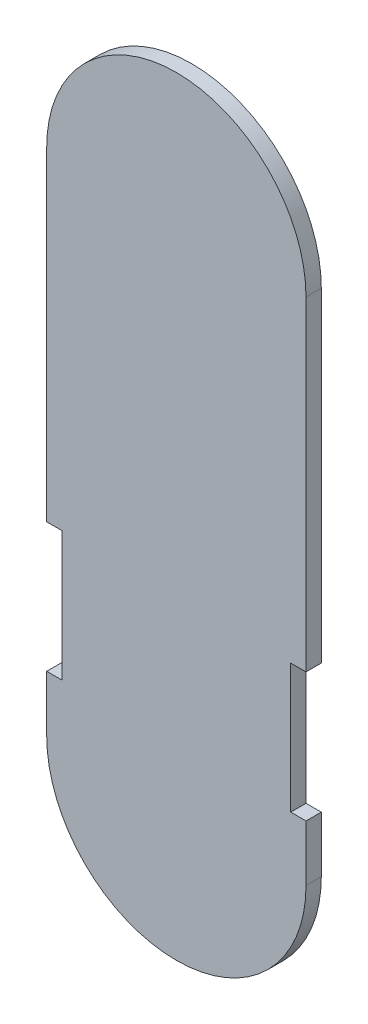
ISO-10303-21;
HEADER;
FILE_DESCRIPTION(('STEP AP214'),'2;1');
FILE_NAME('part.step','',(''),(''),'','','');
FILE_SCHEMA(('AUTOMOTIVE_DESIGN { 1 0 10303 214 1 1 1 1 }'));
ENDSEC;
DATA;
#1=APPLICATION_CONTEXT('core data for automotive mechanical design processes');
#2=APPLICATION_PROTOCOL_DEFINITION('international standard','automotive_design',2000,#1);
#3=PRODUCT_CONTEXT('',#1,'mechanical');
#4=PRODUCT('Part','Part','',(#3));
#5=PRODUCT_RELATED_PRODUCT_CATEGORY('part','',(#4));
#6=PRODUCT_DEFINITION_FORMATION('','',#4);
#7=PRODUCT_DEFINITION_CONTEXT('part definition',#1,'design');
#8=PRODUCT_DEFINITION('design','',#6,#7);
#9=PRODUCT_DEFINITION_SHAPE('','',#8);
#10=(LENGTH_UNIT() NAMED_UNIT(*) SI_UNIT(.MILLI.,.METRE.));
#11=(NAMED_UNIT(*) PLANE_ANGLE_UNIT() SI_UNIT($,.RADIAN.));
#12=(NAMED_UNIT(*) SI_UNIT($,.STERADIAN.) SOLID_ANGLE_UNIT());
#13=UNCERTAINTY_MEASURE_WITH_UNIT(LENGTH_MEASURE(1.E-05),#10,'distance_accuracy_value','');
#14=(GEOMETRIC_REPRESENTATION_CONTEXT(3) GLOBAL_UNCERTAINTY_ASSIGNED_CONTEXT((#13)) GLOBAL_UNIT_ASSIGNED_CONTEXT((#10,
#11,#12)) REPRESENTATION_CONTEXT('',''));
#15=CARTESIAN_POINT('',(0.,0.,0.));
#16=DIRECTION('',(0.,0.,1.));
#17=DIRECTION('',(1.,0.,0.));
#18=AXIS2_PLACEMENT_3D('',#15,#16,#17);
#19=CARTESIAN_POINT('',(26.0514524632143,-23.650430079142,1.524));
#20=DIRECTION('',(0.,1.,0.));
#21=DIRECTION('',(0.,0.,1.));
#22=AXIS2_PLACEMENT_3D('',#19,#20,#21);
#23=PLANE('',#22);
#24=DIRECTION('',(1.,0.,0.));
#25=VECTOR('',#24,1.);
#26=CARTESIAN_POINT('',(26.0514524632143,-23.650430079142,0.));
#27=LINE('',#26,#25);
#28=CARTESIAN_POINT('',(24.5274524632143,-23.650430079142,0.));
#29=VERTEX_POINT('',#28);
#30=CARTESIAN_POINT('',(26.0514524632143,-23.650430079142,0.));
#31=VERTEX_POINT('',#30);
#32=EDGE_CURVE('E152',#29,#31,#27,.T.);
#33=ORIENTED_EDGE('',*,*,#32,.T.);
#34=DIRECTION('',(0.,0.,-1.));
#35=VECTOR('',#34,1.);
#36=CARTESIAN_POINT('',(26.0514524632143,-23.650430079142,1.524));
#37=LINE('',#36,#35);
#38=CARTESIAN_POINT('',(26.0514524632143,-23.650430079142,1.524));
#39=VERTEX_POINT('',#38);
#40=EDGE_CURVE('E11',#39,#31,#37,.T.);
#41=ORIENTED_EDGE('',*,*,#40,.F.);
#42=DIRECTION('',(1.,0.,0.));
#43=VECTOR('',#42,1.);
#44=CARTESIAN_POINT('',(26.0514524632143,-23.650430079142,1.524));
#45=LINE('',#44,#43);
#46=CARTESIAN_POINT('',(24.5274524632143,-23.650430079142,1.524));
#47=VERTEX_POINT('',#46);
#48=EDGE_CURVE('E174',#47,#39,#45,.T.);
#49=ORIENTED_EDGE('',*,*,#48,.F.);
#50=DIRECTION('',(0.,0.,-1.));
#51=VECTOR('',#50,1.);
#52=CARTESIAN_POINT('',(24.5274524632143,-23.650430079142,1.524));
#53=LINE('',#52,#51);
#54=EDGE_CURVE('E148',#47,#29,#53,.T.);
#55=ORIENTED_EDGE('',*,*,#54,.T.);
#56=EDGE_LOOP('',(#33,#41,#49,#55));
#57=FACE_BOUND('',#56,.T.);
#58=ADVANCED_FACE('F32',(#57),#23,.F.);
#59=CARTESIAN_POINT('',(26.0514524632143,8.70992047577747,1.524));
#60=DIRECTION('',(-1.,0.,0.));
#61=DIRECTION('',(0.,0.,1.));
#62=AXIS2_PLACEMENT_3D('',#59,#60,#61);
#63=PLANE('',#62);
#64=DIRECTION('',(0.,1.,0.));
#65=VECTOR('',#64,1.);
#66=CARTESIAN_POINT('',(26.0514524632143,8.70992047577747,0.));
#67=LINE('',#66,#65);
#68=CARTESIAN_POINT('',(26.0514524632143,8.70992047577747,0.));
#69=VERTEX_POINT('',#68);
#70=EDGE_CURVE('E155',#31,#69,#67,.T.);
#71=ORIENTED_EDGE('',*,*,#70,.T.);
#72=DIRECTION('',(0.,0.,-1.));
#73=VECTOR('',#72,1.);
#74=CARTESIAN_POINT('',(26.0514524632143,8.70992047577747,1.524));
#75=LINE('',#74,#73);
#76=CARTESIAN_POINT('',(26.0514524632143,8.70992047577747,1.524));
#77=VERTEX_POINT('',#76);
#78=EDGE_CURVE('E40',#77,#69,#75,.T.);
#79=ORIENTED_EDGE('',*,*,#78,.F.);
#80=DIRECTION('',(0.,1.,0.));
#81=VECTOR('',#80,1.);
#82=CARTESIAN_POINT('',(26.0514524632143,8.70992047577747,1.524));
#83=LINE('',#82,#81);
#84=EDGE_CURVE('E103',#39,#77,#83,.T.);
#85=ORIENTED_EDGE('',*,*,#84,.F.);
#86=ORIENTED_EDGE('',*,*,#40,.T.);
#87=EDGE_LOOP('',(#71,#79,#85,#86));
#88=FACE_BOUND('',#87,.T.);
#89=ADVANCED_FACE('F252',(#88),#63,.F.);
#90=CARTESIAN_POINT('',(13.1287296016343,8.70992047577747,1.524));
#91=DIRECTION('',(0.,0.,-1.));
#92=DIRECTION('',(-1.,0.,0.));
#93=AXIS2_PLACEMENT_3D('',#90,#91,#92);
#94=CYLINDRICAL_SURFACE('',#93,12.92272286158);
#95=CARTESIAN_POINT('',(13.1287296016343,8.70992047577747,0.));
#96=DIRECTION('',(0.,0.,1.));
#97=DIRECTION('',(1.,0.,0.));
#98=AXIS2_PLACEMENT_3D('',#95,#96,#97);
#99=CIRCLE('',#98,12.92272286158);
#100=CARTESIAN_POINT('',(0.206006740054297,8.70992047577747,0.));
#101=VERTEX_POINT('',#100);
#102=EDGE_CURVE('E157',#69,#101,#99,.T.);
#103=ORIENTED_EDGE('',*,*,#102,.T.);
#104=DIRECTION('',(0.,0.,-1.));
#105=VECTOR('',#104,1.);
#106=CARTESIAN_POINT('',(0.206006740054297,8.70992047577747,1.524));
#107=LINE('',#106,#105);
#108=CARTESIAN_POINT('',(0.206006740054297,8.70992047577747,1.524));
#109=VERTEX_POINT('',#108);
#110=EDGE_CURVE('E193',#109,#101,#107,.T.);
#111=ORIENTED_EDGE('',*,*,#110,.F.);
#112=CARTESIAN_POINT('',(13.1287296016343,8.70992047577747,1.524));
#113=DIRECTION('',(0.,0.,1.));
#114=DIRECTION('',(1.,0.,0.));
#115=AXIS2_PLACEMENT_3D('',#112,#113,#114);
#116=CIRCLE('',#115,12.92272286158);
#117=EDGE_CURVE('E201',#77,#109,#116,.T.);
#118=ORIENTED_EDGE('',*,*,#117,.F.);
#119=ORIENTED_EDGE('',*,*,#78,.T.);
#120=EDGE_LOOP('',(#103,#111,#118,#119));
#121=FACE_BOUND('',#120,.T.);
#122=ADVANCED_FACE('F199',(#121),#94,.T.);
#123=CARTESIAN_POINT('',(0.206006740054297,8.70992047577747,1.524));
#124=DIRECTION('',(1.,0.,0.));
#125=DIRECTION('',(0.,1.,0.));
#126=AXIS2_PLACEMENT_3D('',#123,#124,#125);
#127=PLANE('',#126);
#128=DIRECTION('',(0.,-1.,0.));
#129=VECTOR('',#128,1.);
#130=CARTESIAN_POINT('',(0.206006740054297,8.70992047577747,0.));
#131=LINE('',#130,#129);
#132=CARTESIAN_POINT('',(0.206006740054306,-23.6211874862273,0.));
#133=VERTEX_POINT('',#132);
#134=EDGE_CURVE('E159',#101,#133,#131,.T.);
#135=ORIENTED_EDGE('',*,*,#134,.T.);
#136=DIRECTION('',(0.,0.,-1.));
#137=VECTOR('',#136,1.);
#138=CARTESIAN_POINT('',(0.206006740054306,-23.6211874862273,1.524));
#139=LINE('',#138,#137);
#140=CARTESIAN_POINT('',(0.206006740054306,-23.6211874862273,1.524));
#141=VERTEX_POINT('',#140);
#142=EDGE_CURVE('E190',#141,#133,#139,.T.);
#143=ORIENTED_EDGE('',*,*,#142,.F.);
#144=DIRECTION('',(0.,-1.,0.));
#145=VECTOR('',#144,1.);
#146=CARTESIAN_POINT('',(0.206006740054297,8.70992047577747,1.524));
#147=LINE('',#146,#145);
#148=EDGE_CURVE('E219',#109,#141,#147,.T.);
#149=ORIENTED_EDGE('',*,*,#148,.F.);
#150=ORIENTED_EDGE('',*,*,#110,.T.);
#151=EDGE_LOOP('',(#135,#143,#149,#150));
#152=FACE_BOUND('',#151,.T.);
#153=ADVANCED_FACE('F210',(#152),#127,.F.);
#154=CARTESIAN_POINT('',(1.72528777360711,-23.6211874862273,1.524));
#155=DIRECTION('',(0.,1.,0.));
#156=DIRECTION('',(0.,0.,1.));
#157=AXIS2_PLACEMENT_3D('',#154,#155,#156);
#158=PLANE('',#157);
#159=DIRECTION('',(1.,0.,0.));
#160=VECTOR('',#159,1.);
#161=CARTESIAN_POINT('',(1.72528777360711,-23.6211874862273,0.));
#162=LINE('',#161,#160);
#163=CARTESIAN_POINT('',(1.72528777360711,-23.6211874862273,0.));
#164=VERTEX_POINT('',#163);
#165=EDGE_CURVE('E161',#133,#164,#162,.T.);
#166=ORIENTED_EDGE('',*,*,#165,.T.);
#167=DIRECTION('',(0.,0.,-1.));
#168=VECTOR('',#167,1.);
#169=CARTESIAN_POINT('',(1.72528777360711,-23.6211874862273,1.524));
#170=LINE('',#169,#168);
#171=CARTESIAN_POINT('',(1.72528777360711,-23.6211874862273,1.524));
#172=VERTEX_POINT('',#171);
#173=EDGE_CURVE('E187',#172,#164,#170,.T.);
#174=ORIENTED_EDGE('',*,*,#173,.F.);
#175=DIRECTION('',(1.,0.,0.));
#176=VECTOR('',#175,1.);
#177=CARTESIAN_POINT('',(1.72528777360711,-23.6211874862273,1.524));
#178=LINE('',#177,#176);
#179=EDGE_CURVE('E216',#141,#172,#178,.T.);
#180=ORIENTED_EDGE('',*,*,#179,.F.);
#181=ORIENTED_EDGE('',*,*,#142,.T.);
#182=EDGE_LOOP('',(#166,#174,#180,#181));
#183=FACE_BOUND('',#182,.T.);
#184=ADVANCED_FACE('F214',(#183),#158,.F.);
#185=CARTESIAN_POINT('',(1.72528777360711,-36.5181421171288,1.524));
#186=DIRECTION('',(1.,0.,0.));
#187=DIRECTION('',(0.,0.,-1.));
#188=AXIS2_PLACEMENT_3D('',#185,#186,#187);
#189=PLANE('',#188);
#190=DIRECTION('',(0.,-1.,0.));
#191=VECTOR('',#190,1.);
#192=CARTESIAN_POINT('',(1.72528777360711,-36.5181421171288,0.));
#193=LINE('',#192,#191);
#194=CARTESIAN_POINT('',(1.72528777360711,-36.5181421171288,0.));
#195=VERTEX_POINT('',#194);
#196=EDGE_CURVE('E163',#164,#195,#193,.T.);
#197=ORIENTED_EDGE('',*,*,#196,.T.);
#198=DIRECTION('',(0.,0.,-1.));
#199=VECTOR('',#198,1.);
#200=CARTESIAN_POINT('',(1.72528777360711,-36.5181421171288,1.524));
#201=LINE('',#200,#199);
#202=CARTESIAN_POINT('',(1.72528777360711,-36.5181421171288,1.524));
#203=VERTEX_POINT('',#202);
#204=EDGE_CURVE('E184',#203,#195,#201,.T.);
#205=ORIENTED_EDGE('',*,*,#204,.F.);
#206=DIRECTION('',(0.,-1.,0.));
#207=VECTOR('',#206,1.);
#208=CARTESIAN_POINT('',(1.72528777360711,-36.5181421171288,1.524));
#209=LINE('',#208,#207);
#210=EDGE_CURVE('E218',#172,#203,#209,.T.);
#211=ORIENTED_EDGE('',*,*,#210,.F.);
#212=ORIENTED_EDGE('',*,*,#173,.T.);
#213=EDGE_LOOP('',(#197,#205,#211,#212));
#214=FACE_BOUND('',#213,.T.);
#215=ADVANCED_FACE('F265',(#214),#189,.F.);
#216=CARTESIAN_POINT('',(1.72528777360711,-36.5181421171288,1.524));
#217=DIRECTION('',(0.,-1.,0.));
#218=DIRECTION('',(0.,0.,-1.));
#219=AXIS2_PLACEMENT_3D('',#216,#217,#218);
#220=PLANE('',#219);
#221=DIRECTION('',(-1.,0.,0.));
#222=VECTOR('',#221,1.);
#223=CARTESIAN_POINT('',(1.72528777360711,-36.5181421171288,0.));
#224=LINE('',#223,#222);
#225=CARTESIAN_POINT('',(0.206006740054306,-36.5181421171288,0.));
#226=VERTEX_POINT('',#225);
#227=EDGE_CURVE('E165',#195,#226,#224,.T.);
#228=ORIENTED_EDGE('',*,*,#227,.T.);
#229=DIRECTION('',(0.,0.,-1.));
#230=VECTOR('',#229,1.);
#231=CARTESIAN_POINT('',(0.206006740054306,-36.5181421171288,1.524));
#232=LINE('',#231,#230);
#233=CARTESIAN_POINT('',(0.206006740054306,-36.5181421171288,1.524));
#234=VERTEX_POINT('',#233);
#235=EDGE_CURVE('E181',#234,#226,#232,.T.);
#236=ORIENTED_EDGE('',*,*,#235,.F.);
#237=DIRECTION('',(-1.,0.,0.));
#238=VECTOR('',#237,1.);
#239=CARTESIAN_POINT('',(1.72528777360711,-36.5181421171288,1.524));
#240=LINE('',#239,#238);
#241=EDGE_CURVE('E221',#203,#234,#240,.T.);
#242=ORIENTED_EDGE('',*,*,#241,.F.);
#243=ORIENTED_EDGE('',*,*,#204,.T.);
#244=EDGE_LOOP('',(#228,#236,#242,#243));
#245=FACE_BOUND('',#244,.T.);
#246=ADVANCED_FACE('F268',(#245),#220,.F.);
#247=CARTESIAN_POINT('',(0.206006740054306,-36.5181421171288,1.524));
#248=DIRECTION('',(1.,0.,0.));
#249=DIRECTION('',(0.,1.,0.));
#250=AXIS2_PLACEMENT_3D('',#247,#248,#249);
#251=PLANE('',#250);
#252=DIRECTION('',(0.,-1.,0.));
#253=VECTOR('',#252,1.);
#254=CARTESIAN_POINT('',(0.206006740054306,-36.5181421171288,0.));
#255=LINE('',#254,#253);
#256=CARTESIAN_POINT('',(0.206006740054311,-42.0900795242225,0.));
#257=VERTEX_POINT('',#256);
#258=EDGE_CURVE('E167',#226,#257,#255,.T.);
#259=ORIENTED_EDGE('',*,*,#258,.T.);
#260=DIRECTION('',(0.,0.,-1.));
#261=VECTOR('',#260,1.);
#262=CARTESIAN_POINT('',(0.206006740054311,-42.0900795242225,1.524));
#263=LINE('',#262,#261);
#264=CARTESIAN_POINT('',(0.206006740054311,-42.0900795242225,1.524));
#265=VERTEX_POINT('',#264);
#266=EDGE_CURVE('E178',#265,#257,#263,.T.);
#267=ORIENTED_EDGE('',*,*,#266,.F.);
#268=DIRECTION('',(0.,-1.,0.));
#269=VECTOR('',#268,1.);
#270=CARTESIAN_POINT('',(0.206006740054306,-36.5181421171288,1.524));
#271=LINE('',#270,#269);
#272=EDGE_CURVE('E227',#234,#265,#271,.T.);
#273=ORIENTED_EDGE('',*,*,#272,.F.);
#274=ORIENTED_EDGE('',*,*,#235,.T.);
#275=EDGE_LOOP('',(#259,#267,#273,#274));
#276=FACE_BOUND('',#275,.T.);
#277=ADVANCED_FACE('F233',(#276),#251,.F.);
#278=CARTESIAN_POINT('',(13.1287296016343,-42.0900795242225,1.524));
#279=DIRECTION('',(0.,0.,-1.));
#280=DIRECTION('',(-1.,0.,0.));
#281=AXIS2_PLACEMENT_3D('',#278,#279,#280);
#282=CYLINDRICAL_SURFACE('',#281,12.92272286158);
#283=CARTESIAN_POINT('',(13.1287296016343,-42.0900795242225,0.));
#284=DIRECTION('',(0.,0.,1.));
#285=DIRECTION('',(1.,0.,0.));
#286=AXIS2_PLACEMENT_3D('',#283,#284,#285);
#287=CIRCLE('',#286,12.92272286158);
#288=CARTESIAN_POINT('',(26.0514524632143,-42.0900795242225,0.));
#289=VERTEX_POINT('',#288);
#290=EDGE_CURVE('E169',#257,#289,#287,.T.);
#291=ORIENTED_EDGE('',*,*,#290,.T.);
#292=DIRECTION('',(0.,0.,-1.));
#293=VECTOR('',#292,1.);
#294=CARTESIAN_POINT('',(26.0514524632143,-42.0900795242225,1.524));
#295=LINE('',#294,#293);
#296=CARTESIAN_POINT('',(26.0514524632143,-42.0900795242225,1.524));
#297=VERTEX_POINT('',#296);
#298=EDGE_CURVE('E143',#297,#289,#295,.T.);
#299=ORIENTED_EDGE('',*,*,#298,.F.);
#300=CARTESIAN_POINT('',(13.1287296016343,-42.0900795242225,1.524));
#301=DIRECTION('',(0.,0.,1.));
#302=DIRECTION('',(1.,0.,0.));
#303=AXIS2_PLACEMENT_3D('',#300,#301,#302);
#304=CIRCLE('',#303,12.92272286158);
#305=EDGE_CURVE('E134',#265,#297,#304,.T.);
#306=ORIENTED_EDGE('',*,*,#305,.F.);
#307=ORIENTED_EDGE('',*,*,#266,.T.);
#308=EDGE_LOOP('',(#291,#299,#306,#307));
#309=FACE_BOUND('',#308,.T.);
#310=ADVANCED_FACE('F237',(#309),#282,.T.);
#311=CARTESIAN_POINT('',(26.0514524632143,-36.5153857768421,1.524));
#312=DIRECTION('',(-1.,0.,0.));
#313=DIRECTION('',(0.,0.,1.));
#314=AXIS2_PLACEMENT_3D('',#311,#312,#313);
#315=PLANE('',#314);
#316=DIRECTION('',(0.,1.,0.));
#317=VECTOR('',#316,1.);
#318=CARTESIAN_POINT('',(26.0514524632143,-36.5153857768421,0.));
#319=LINE('',#318,#317);
#320=CARTESIAN_POINT('',(26.0514524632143,-36.5153857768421,0.));
#321=VERTEX_POINT('',#320);
#322=EDGE_CURVE('E142',#289,#321,#319,.T.);
#323=ORIENTED_EDGE('',*,*,#322,.T.);
#324=DIRECTION('',(0.,0.,-1.));
#325=VECTOR('',#324,1.);
#326=CARTESIAN_POINT('',(26.0514524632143,-36.5153857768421,1.524));
#327=LINE('',#326,#325);
#328=CARTESIAN_POINT('',(26.0514524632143,-36.5153857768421,1.524));
#329=VERTEX_POINT('',#328);
#330=EDGE_CURVE('E139',#329,#321,#327,.T.);
#331=ORIENTED_EDGE('',*,*,#330,.F.);
#332=DIRECTION('',(0.,1.,0.));
#333=VECTOR('',#332,1.);
#334=CARTESIAN_POINT('',(26.0514524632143,-36.5153857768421,1.524));
#335=LINE('',#334,#333);
#336=EDGE_CURVE('E128',#297,#329,#335,.T.);
#337=ORIENTED_EDGE('',*,*,#336,.F.);
#338=ORIENTED_EDGE('',*,*,#298,.T.);
#339=EDGE_LOOP('',(#323,#331,#337,#338));
#340=FACE_BOUND('',#339,.T.);
#341=ADVANCED_FACE('F140',(#340),#315,.F.);
#342=CARTESIAN_POINT('',(26.0514524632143,-36.5153857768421,1.524));
#343=DIRECTION('',(0.,-1.,0.));
#344=DIRECTION('',(0.,0.,-1.));
#345=AXIS2_PLACEMENT_3D('',#342,#343,#344);
#346=PLANE('',#345);
#347=DIRECTION('',(-1.,0.,0.));
#348=VECTOR('',#347,1.);
#349=CARTESIAN_POINT('',(26.0514524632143,-36.5153857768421,0.));
#350=LINE('',#349,#348);
#351=CARTESIAN_POINT('',(24.5274524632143,-36.5153857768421,0.));
#352=VERTEX_POINT('',#351);
#353=EDGE_CURVE('E89',#321,#352,#350,.T.);
#354=ORIENTED_EDGE('',*,*,#353,.T.);
#355=DIRECTION('',(0.,0.,-1.));
#356=VECTOR('',#355,1.);
#357=CARTESIAN_POINT('',(24.5274524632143,-36.5153857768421,1.524));
#358=LINE('',#357,#356);
#359=CARTESIAN_POINT('',(24.5274524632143,-36.5153857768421,1.524));
#360=VERTEX_POINT('',#359);
#361=EDGE_CURVE('E144',#360,#352,#358,.T.);
#362=ORIENTED_EDGE('',*,*,#361,.F.);
#363=DIRECTION('',(-1.,0.,0.));
#364=VECTOR('',#363,1.);
#365=CARTESIAN_POINT('',(26.0514524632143,-36.5153857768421,1.524));
#366=LINE('',#365,#364);
#367=EDGE_CURVE('E132',#329,#360,#366,.T.);
#368=ORIENTED_EDGE('',*,*,#367,.F.);
#369=ORIENTED_EDGE('',*,*,#330,.T.);
#370=EDGE_LOOP('',(#354,#362,#368,#369));
#371=FACE_BOUND('',#370,.T.);
#372=ADVANCED_FACE('F146',(#371),#346,.F.);
#373=CARTESIAN_POINT('',(24.5274524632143,-23.650430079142,1.524));
#374=DIRECTION('',(-1.,0.,0.));
#375=DIRECTION('',(0.,0.,1.));
#376=AXIS2_PLACEMENT_3D('',#373,#374,#375);
#377=PLANE('',#376);
#378=DIRECTION('',(0.,1.,0.));
#379=VECTOR('',#378,1.);
#380=CARTESIAN_POINT('',(24.5274524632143,-23.650430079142,0.));
#381=LINE('',#380,#379);
#382=EDGE_CURVE('E95',#352,#29,#381,.T.);
#383=ORIENTED_EDGE('',*,*,#382,.T.);
#384=ORIENTED_EDGE('',*,*,#54,.F.);
#385=DIRECTION('',(0.,1.,0.));
#386=VECTOR('',#385,1.);
#387=CARTESIAN_POINT('',(24.5274524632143,-23.650430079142,1.524));
#388=LINE('',#387,#386);
#389=EDGE_CURVE('E48',#360,#47,#388,.T.);
#390=ORIENTED_EDGE('',*,*,#389,.F.);
#391=ORIENTED_EDGE('',*,*,#361,.T.);
#392=EDGE_LOOP('',(#383,#384,#390,#391));
#393=FACE_BOUND('',#392,.T.);
#394=ADVANCED_FACE('F241',(#393),#377,.F.);
#395=CARTESIAN_POINT('',(13.1287296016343,-42.0900795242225,1.524));
#396=DIRECTION('',(0.,0.,1.));
#397=DIRECTION('',(1.,0.,0.));
#398=AXIS2_PLACEMENT_3D('',#395,#396,#397);
#399=PLANE('',#398);
#400=ORIENTED_EDGE('',*,*,#48,.T.);
#401=ORIENTED_EDGE('',*,*,#84,.T.);
#402=ORIENTED_EDGE('',*,*,#117,.T.);
#403=ORIENTED_EDGE('',*,*,#148,.T.);
#404=ORIENTED_EDGE('',*,*,#179,.T.);
#405=ORIENTED_EDGE('',*,*,#210,.T.);
#406=ORIENTED_EDGE('',*,*,#241,.T.);
#407=ORIENTED_EDGE('',*,*,#272,.T.);
#408=ORIENTED_EDGE('',*,*,#305,.T.);
#409=ORIENTED_EDGE('',*,*,#336,.T.);
#410=ORIENTED_EDGE('',*,*,#367,.T.);
#411=ORIENTED_EDGE('',*,*,#389,.T.);
#412=EDGE_LOOP('',(#400,#401,#402,#403,#404,#405,#406,#407,#408,#409,#410,#411));
#413=FACE_BOUND('',#412,.T.);
#414=ADVANCED_FACE('F130',(#413),#399,.T.);
#415=CARTESIAN_POINT('',(13.1287296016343,-42.0900795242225,0.));
#416=DIRECTION('',(0.,0.,1.));
#417=DIRECTION('',(1.,0.,0.));
#418=AXIS2_PLACEMENT_3D('',#415,#416,#417);
#419=PLANE('',#418);
#420=ORIENTED_EDGE('',*,*,#32,.F.);
#421=ORIENTED_EDGE('',*,*,#382,.F.);
#422=ORIENTED_EDGE('',*,*,#353,.F.);
#423=ORIENTED_EDGE('',*,*,#322,.F.);
#424=ORIENTED_EDGE('',*,*,#290,.F.);
#425=ORIENTED_EDGE('',*,*,#258,.F.);
#426=ORIENTED_EDGE('',*,*,#227,.F.);
#427=ORIENTED_EDGE('',*,*,#196,.F.);
#428=ORIENTED_EDGE('',*,*,#165,.F.);
#429=ORIENTED_EDGE('',*,*,#134,.F.);
#430=ORIENTED_EDGE('',*,*,#102,.F.);
#431=ORIENTED_EDGE('',*,*,#70,.F.);
#432=EDGE_LOOP('',(#420,#421,#422,#423,#424,#425,#426,#427,#428,#429,#430,#431));
#433=FACE_BOUND('',#432,.T.);
#434=ADVANCED_FACE('F205',(#433),#419,.F.);
#435=CLOSED_SHELL('',(#58,#89,#122,#153,#184,#215,#246,#277,#310,#341,#372,#394,#414,#434));
#436=MANIFOLD_SOLID_BREP('B2',#435);
#437=ADVANCED_BREP_SHAPE_REPRESENTATION('',(#18,#436),#14);
#438=SHAPE_DEFINITION_REPRESENTATION(#9,#437);
ENDSEC;
END-ISO-10303-21;
